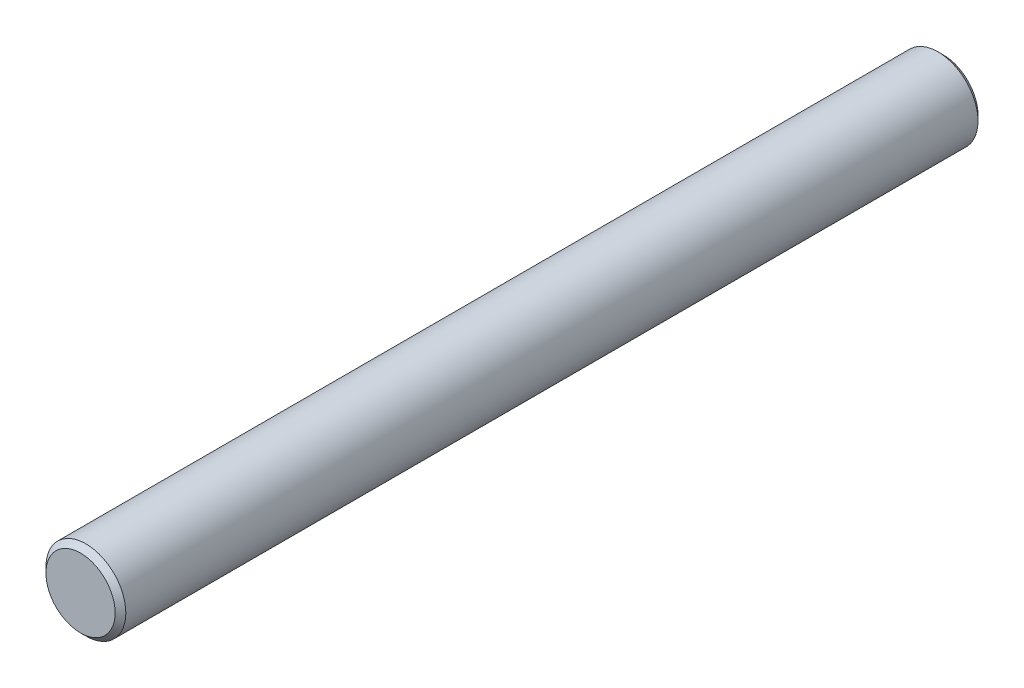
from build123d import *

# Parameters (mm, degrees)
ESQUISSE1_R      = 1.5
EXTRUSION1_DEPTH = 32.4
CHANFREIN1_SIZE  = 0.2


with BuildPart() as part:
    # Esquisse1 → Extrusion1 (new body)
    with BuildSketch(Plane.XY):
        Circle(ESQUISSE1_R)
    extrude(amount=EXTRUSION1_DEPTH)

    # Chanfrein1
    chanfrein1_edges = [part.edges().sort_by_distance(p)[0] for p in [
        (-1.5, 0, 0),
        (-1.5, 0, 32.4),
    ]]
    chamfer(chanfrein1_edges, length=CHANFREIN1_SIZE)


solid = part.part
